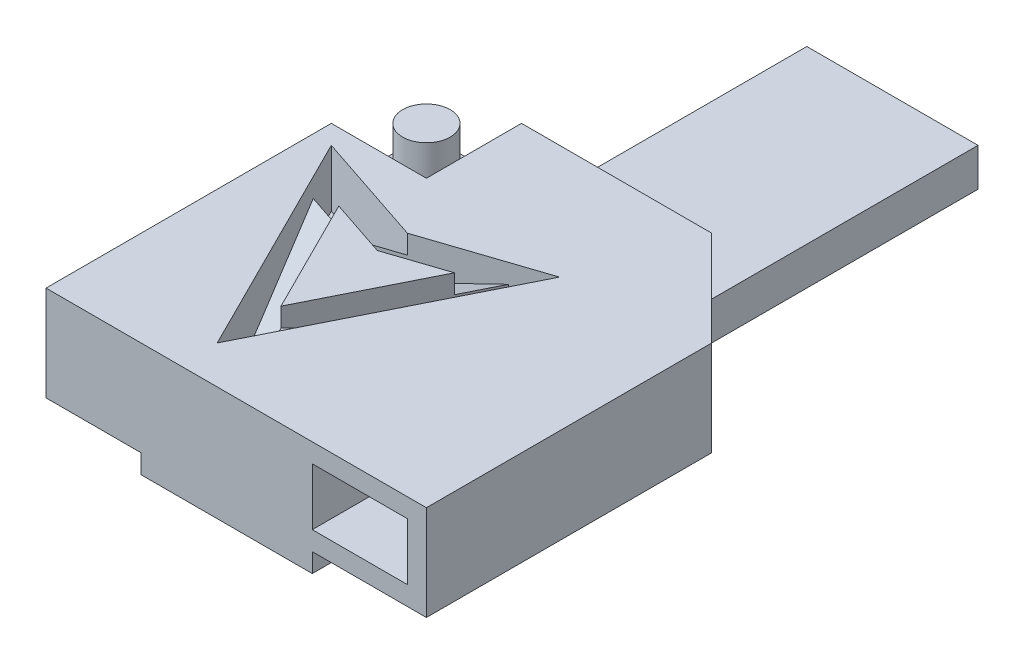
ISO-10303-21;
HEADER;
FILE_DESCRIPTION(('STEP AP214'),'2;1');
FILE_NAME('part.step','',(''),(''),'','','');
FILE_SCHEMA(('AUTOMOTIVE_DESIGN { 1 0 10303 214 1 1 1 1 }'));
ENDSEC;
DATA;
#1=APPLICATION_CONTEXT('core data for automotive mechanical design processes');
#2=APPLICATION_PROTOCOL_DEFINITION('international standard','automotive_design',2000,#1);
#3=PRODUCT_CONTEXT('',#1,'mechanical');
#4=PRODUCT('Part','Part','',(#3));
#5=PRODUCT_RELATED_PRODUCT_CATEGORY('part','',(#4));
#6=PRODUCT_DEFINITION_FORMATION('','',#4);
#7=PRODUCT_DEFINITION_CONTEXT('part definition',#1,'design');
#8=PRODUCT_DEFINITION('design','',#6,#7);
#9=PRODUCT_DEFINITION_SHAPE('','',#8);
#10=(LENGTH_UNIT() NAMED_UNIT(*) SI_UNIT(.MILLI.,.METRE.));
#11=(NAMED_UNIT(*) PLANE_ANGLE_UNIT() SI_UNIT($,.RADIAN.));
#12=(NAMED_UNIT(*) SI_UNIT($,.STERADIAN.) SOLID_ANGLE_UNIT());
#13=UNCERTAINTY_MEASURE_WITH_UNIT(LENGTH_MEASURE(1.E-05),#10,'distance_accuracy_value','');
#14=(GEOMETRIC_REPRESENTATION_CONTEXT(3) GLOBAL_UNCERTAINTY_ASSIGNED_CONTEXT((#13)) GLOBAL_UNIT_ASSIGNED_CONTEXT((#10,
#11,#12)) REPRESENTATION_CONTEXT('',''));
#15=CARTESIAN_POINT('',(0.,0.,0.));
#16=DIRECTION('',(0.,0.,1.));
#17=DIRECTION('',(1.,0.,0.));
#18=AXIS2_PLACEMENT_3D('',#15,#16,#17);
#19=CARTESIAN_POINT('',(-10.,5.,-10.));
#20=DIRECTION('',(0.,0.,1.));
#21=DIRECTION('',(1.,0.,0.));
#22=AXIS2_PLACEMENT_3D('',#19,#20,#21);
#23=PLANE('',#22);
#24=DIRECTION('',(-1.,0.,0.));
#25=VECTOR('',#24,1.);
#26=CARTESIAN_POINT('',(-10.,0.,-10.));
#27=LINE('',#26,#25);
#28=CARTESIAN_POINT('',(5.,0.,-10.));
#29=VERTEX_POINT('',#28);
#30=CARTESIAN_POINT('',(4.,0.,-10.));
#31=VERTEX_POINT('',#30);
#32=EDGE_CURVE('E547',#29,#31,#27,.T.);
#33=ORIENTED_EDGE('',*,*,#32,.T.);
#34=DIRECTION('',(0.,1.,0.));
#35=VECTOR('',#34,1.);
#36=CARTESIAN_POINT('',(4.,5.,-10.));
#37=LINE('',#36,#35);
#38=CARTESIAN_POINT('',(4.,1.,-10.));
#39=VERTEX_POINT('',#38);
#40=EDGE_CURVE('E307',#31,#39,#37,.T.);
#41=ORIENTED_EDGE('',*,*,#40,.T.);
#42=DIRECTION('',(1.,0.,0.));
#43=VECTOR('',#42,1.);
#44=CARTESIAN_POINT('',(9.,1.,-10.));
#45=LINE('',#44,#43);
#46=CARTESIAN_POINT('',(5.,1.,-10.));
#47=VERTEX_POINT('',#46);
#48=EDGE_CURVE('E319',#39,#47,#45,.T.);
#49=ORIENTED_EDGE('',*,*,#48,.T.);
#50=DIRECTION('',(0.,-1.,0.));
#51=VECTOR('',#50,1.);
#52=CARTESIAN_POINT('',(5.,5.,-10.));
#53=LINE('',#52,#51);
#54=EDGE_CURVE('E583',#47,#29,#53,.T.);
#55=ORIENTED_EDGE('',*,*,#54,.T.);
#56=EDGE_LOOP('',(#33,#41,#49,#55));
#57=FACE_BOUND('',#56,.T.);
#58=ADVANCED_FACE('F43',(#57),#23,.F.);
#59=CARTESIAN_POINT('',(0.,0.,0.));
#60=DIRECTION('',(0.,-1.,0.));
#61=DIRECTION('',(0.,0.,-1.));
#62=AXIS2_PLACEMENT_3D('',#59,#60,#61);
#63=PLANE('',#62);
#64=DIRECTION('',(0.,0.,1.));
#65=VECTOR('',#64,1.);
#66=CARTESIAN_POINT('',(4.,0.,0.));
#67=LINE('',#66,#65);
#68=CARTESIAN_POINT('',(4.,0.,10.));
#69=VERTEX_POINT('',#68);
#70=EDGE_CURVE('E304',#31,#69,#67,.T.);
#71=ORIENTED_EDGE('',*,*,#70,.F.);
#72=ORIENTED_EDGE('',*,*,#32,.F.);
#73=DIRECTION('',(-0.707106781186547,0.,-0.707106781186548));
#74=VECTOR('',#73,1.);
#75=CARTESIAN_POINT('',(5.,0.,-10.));
#76=LINE('',#75,#74);
#77=CARTESIAN_POINT('',(10.,0.,-5.));
#78=VERTEX_POINT('',#77);
#79=EDGE_CURVE('E572',#78,#29,#76,.T.);
#80=ORIENTED_EDGE('',*,*,#79,.F.);
#81=DIRECTION('',(0.,0.,-1.));
#82=VECTOR('',#81,1.);
#83=CARTESIAN_POINT('',(10.,0.,10.));
#84=LINE('',#83,#82);
#85=CARTESIAN_POINT('',(10.,0.,10.));
#86=VERTEX_POINT('',#85);
#87=EDGE_CURVE('E569',#86,#78,#84,.T.);
#88=ORIENTED_EDGE('',*,*,#87,.F.);
#89=DIRECTION('',(1.,0.,0.));
#90=VECTOR('',#89,1.);
#91=CARTESIAN_POINT('',(-10.,0.,10.));
#92=LINE('',#91,#90);
#93=EDGE_CURVE('E564',#69,#86,#92,.T.);
#94=ORIENTED_EDGE('',*,*,#93,.F.);
#95=EDGE_LOOP('',(#71,#72,#80,#88,#94));
#96=FACE_BOUND('',#95,.T.);
#97=ADVANCED_FACE('F641',(#96),#63,.T.);
#98=CARTESIAN_POINT('',(0.,2.,0.));
#99=DIRECTION('',(0.,1.,0.));
#100=DIRECTION('',(0.,0.,1.));
#101=AXIS2_PLACEMENT_3D('',#98,#99,#100);
#102=PLANE('',#101);
#103=DIRECTION('',(-0.948683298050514,0.,0.316227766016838));
#104=VECTOR('',#103,1.);
#105=CARTESIAN_POINT('',(-3.,2.,-2.));
#106=LINE('',#105,#104);
#107=CARTESIAN_POINT('',(3.,2.,-4.));
#108=VERTEX_POINT('',#107);
#109=CARTESIAN_POINT('',(0.987538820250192,2.,-3.32917960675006));
#110=VERTEX_POINT('',#109);
#111=EDGE_CURVE('E489',#108,#110,#106,.T.);
#112=ORIENTED_EDGE('',*,*,#111,.T.);
#113=DIRECTION('',(-0.447213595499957,0.,-0.894427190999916));
#114=VECTOR('',#113,1.);
#115=CARTESIAN_POINT('',(8.12259732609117,2.,10.9409374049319));
#116=LINE('',#115,#114);
#117=CARTESIAN_POINT('',(1.82606431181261,2.,-1.65212862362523));
#118=VERTEX_POINT('',#117);
#119=EDGE_CURVE('E364',#118,#110,#116,.T.);
#120=ORIENTED_EDGE('',*,*,#119,.F.);
#121=DIRECTION('',(0.447213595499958,0.,-0.894427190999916));
#122=VECTOR('',#121,1.);
#123=CARTESIAN_POINT('',(3.,2.,-4.));
#124=LINE('',#123,#122);
#125=EDGE_CURVE('E475',#118,#108,#124,.T.);
#126=ORIENTED_EDGE('',*,*,#125,.T.);
#127=EDGE_LOOP('',(#112,#120,#126));
#128=FACE_BOUND('',#127,.T.);
#129=ADVANCED_FACE('F653',(#128),#102,.T.);
#130=CARTESIAN_POINT('',(3.,2.,-4.));
#131=DIRECTION('',(0.894427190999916,0.,0.447213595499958));
#132=DIRECTION('',(0.447213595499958,0.,-0.894427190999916));
#133=AXIS2_PLACEMENT_3D('',#130,#131,#132);
#134=PLANE('',#133);
#135=DIRECTION('',(0.,-1.,0.));
#136=VECTOR('',#135,1.);
#137=CARTESIAN_POINT('',(-2.16147450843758,4.,6.32294901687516));
#138=LINE('',#137,#136);
#139=CARTESIAN_POINT('',(-2.16147450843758,4.,6.32294901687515));
#140=VERTEX_POINT('',#139);
#141=CARTESIAN_POINT('',(-2.16147450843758,2.,6.32294901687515));
#142=VERTEX_POINT('',#141);
#143=EDGE_CURVE('E357',#140,#142,#138,.T.);
#144=ORIENTED_EDGE('',*,*,#143,.T.);
#145=CARTESIAN_POINT('',(-3.,2.,8.));
#146=VERTEX_POINT('',#145);
#147=EDGE_CURVE('E502',#146,#142,#124,.T.);
#148=ORIENTED_EDGE('',*,*,#147,.F.);
#149=DIRECTION('',(0.,1.,0.));
#150=VECTOR('',#149,1.);
#151=CARTESIAN_POINT('',(-3.,2.,8.));
#152=LINE('',#151,#150);
#153=CARTESIAN_POINT('',(-3.,5.,8.));
#154=VERTEX_POINT('',#153);
#155=EDGE_CURVE('E479',#146,#154,#152,.T.);
#156=ORIENTED_EDGE('',*,*,#155,.T.);
#157=DIRECTION('',(0.447213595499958,0.,-0.894427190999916));
#158=VECTOR('',#157,1.);
#159=CARTESIAN_POINT('',(3.,5.,-4.));
#160=LINE('',#159,#158);
#161=CARTESIAN_POINT('',(3.,5.,-4.));
#162=VERTEX_POINT('',#161);
#163=EDGE_CURVE('E484',#154,#162,#160,.T.);
#164=ORIENTED_EDGE('',*,*,#163,.T.);
#165=DIRECTION('',(0.,1.,0.));
#166=VECTOR('',#165,1.);
#167=CARTESIAN_POINT('',(3.,2.,-4.));
#168=LINE('',#167,#166);
#169=EDGE_CURVE('E426',#108,#162,#168,.T.);
#170=ORIENTED_EDGE('',*,*,#169,.F.);
#171=ORIENTED_EDGE('',*,*,#125,.F.);
#172=DIRECTION('',(-0.436370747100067,0.218867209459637,0.872741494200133));
#173=VECTOR('',#172,1.);
#174=CARTESIAN_POINT('',(-1.77088235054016,3.80409361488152,5.54176470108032));
#175=LINE('',#174,#173);
#176=EDGE_CURVE('E367',#118,#140,#175,.T.);
#177=ORIENTED_EDGE('',*,*,#176,.T.);
#178=EDGE_LOOP('',(#144,#148,#156,#164,#170,#171,#177));
#179=FACE_BOUND('',#178,.T.);
#180=ADVANCED_FACE('F656',(#179),#134,.F.);
#181=CARTESIAN_POINT('',(0.0388555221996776,2.,-1.43181301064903));
#182=DIRECTION('',(0.894427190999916,0.,0.447213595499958));
#183=DIRECTION('',(0.447213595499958,0.,-0.894427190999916));
#184=AXIS2_PLACEMENT_3D('',#181,#182,#183);
#185=PLANE('',#184);
#186=DIRECTION('',(0.,1.,0.));
#187=VECTOR('',#186,1.);
#188=CARTESIAN_POINT('',(-3.,2.,4.64589803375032));
#189=LINE('',#188,#187);
#190=CARTESIAN_POINT('',(-3.,4.,4.64589803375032));
#191=VERTEX_POINT('',#190);
#192=CARTESIAN_POINT('',(-3.,5.,4.64589803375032));
#193=VERTEX_POINT('',#192);
#194=EDGE_CURVE('E524',#191,#193,#189,.T.);
#195=ORIENTED_EDGE('',*,*,#194,.F.);
#196=DIRECTION('',(-0.436370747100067,0.218867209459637,0.872741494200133));
#197=VECTOR('',#196,1.);
#198=CARTESIAN_POINT('',(0.987538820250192,2.,-3.32917960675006));
#199=LINE('',#198,#197);
#200=EDGE_CURVE('E358',#110,#191,#199,.T.);
#201=ORIENTED_EDGE('',*,*,#200,.F.);
#202=DIRECTION('',(0.,1.,0.));
#203=VECTOR('',#202,1.);
#204=CARTESIAN_POINT('',(0.987538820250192,4.,-3.32917960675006));
#205=LINE('',#204,#203);
#206=CARTESIAN_POINT('',(0.987538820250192,4.,-3.32917960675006));
#207=VERTEX_POINT('',#206);
#208=EDGE_CURVE('E387',#110,#207,#205,.T.);
#209=ORIENTED_EDGE('',*,*,#208,.T.);
#210=DIRECTION('',(0.447213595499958,0.,-0.894427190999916));
#211=VECTOR('',#210,1.);
#212=CARTESIAN_POINT('',(-6.54253521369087,4.,11.7309684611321));
#213=LINE('',#212,#211);
#214=CARTESIAN_POINT('',(0.0388555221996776,4.,-1.43181301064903));
#215=VERTEX_POINT('',#214);
#216=EDGE_CURVE('E379',#215,#207,#213,.T.);
#217=ORIENTED_EDGE('',*,*,#216,.F.);
#218=DIRECTION('',(0.,1.,0.));
#219=VECTOR('',#218,1.);
#220=CARTESIAN_POINT('',(0.0388555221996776,2.,-1.43181301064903));
#221=LINE('',#220,#219);
#222=CARTESIAN_POINT('',(0.0388555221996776,5.,-1.43181301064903));
#223=VERTEX_POINT('',#222);
#224=EDGE_CURVE('E501',#215,#223,#221,.T.);
#225=ORIENTED_EDGE('',*,*,#224,.T.);
#226=DIRECTION('',(0.447213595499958,0.,-0.894427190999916));
#227=VECTOR('',#226,1.);
#228=CARTESIAN_POINT('',(0.0388555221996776,5.,-1.43181301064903));
#229=LINE('',#228,#227);
#230=EDGE_CURVE('E520',#193,#223,#229,.T.);
#231=ORIENTED_EDGE('',*,*,#230,.F.);
#232=EDGE_LOOP('',(#195,#201,#209,#217,#225,#231));
#233=FACE_BOUND('',#232,.T.);
#234=ADVANCED_FACE('F666',(#233),#185,.T.);
#235=CARTESIAN_POINT('',(-6.03885552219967,2.,-1.43181301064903));
#236=DIRECTION('',(0.316227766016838,0.,-0.948683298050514));
#237=DIRECTION('',(-0.948683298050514,0.,-0.316227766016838));
#238=AXIS2_PLACEMENT_3D('',#235,#236,#237);
#239=PLANE('',#238);
#240=DIRECTION('',(0.,1.,0.));
#241=VECTOR('',#240,1.);
#242=CARTESIAN_POINT('',(-3.,2.,-0.418861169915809));
#243=LINE('',#242,#241);
#244=CARTESIAN_POINT('',(-3.,3.04427191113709,-0.418861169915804));
#245=VERTEX_POINT('',#244);
#246=CARTESIAN_POINT('',(-3.,5.,-0.418861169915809));
#247=VERTEX_POINT('',#246);
#248=EDGE_CURVE('E517',#245,#247,#243,.T.);
#249=ORIENTED_EDGE('',*,*,#248,.F.);
#250=DIRECTION('',(0.875383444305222,0.385434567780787,0.291794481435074));
#251=VECTOR('',#250,1.);
#252=CARTESIAN_POINT('',(-7.29513055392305,1.15311004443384,-1.85057135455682));
#253=LINE('',#252,#251);
#254=CARTESIAN_POINT('',(-5.37170824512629,2.,-1.2094305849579));
#255=VERTEX_POINT('',#254);
#256=EDGE_CURVE('E376',#255,#245,#253,.T.);
#257=ORIENTED_EDGE('',*,*,#256,.F.);
#258=DIRECTION('',(0.,-1.,0.));
#259=VECTOR('',#258,1.);
#260=CARTESIAN_POINT('',(-5.37170824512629,4.,-1.2094305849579));
#261=LINE('',#260,#259);
#262=CARTESIAN_POINT('',(-5.37170824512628,4.,-1.2094305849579));
#263=VERTEX_POINT('',#262);
#264=EDGE_CURVE('E397',#263,#255,#261,.T.);
#265=ORIENTED_EDGE('',*,*,#264,.F.);
#266=DIRECTION('',(0.774242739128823,0.577877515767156,0.258080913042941));
#267=VECTOR('',#266,1.);
#268=CARTESIAN_POINT('',(-8.05131670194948,2.,-2.10263340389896));
#269=LINE('',#268,#267);
#270=CARTESIAN_POINT('',(-8.05131670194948,2.,-2.10263340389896));
#271=VERTEX_POINT('',#270);
#272=EDGE_CURVE('E393',#271,#263,#269,.T.);
#273=ORIENTED_EDGE('',*,*,#272,.F.);
#274=DIRECTION('',(0.,-1.,0.));
#275=VECTOR('',#274,1.);
#276=CARTESIAN_POINT('',(-8.05131670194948,2.,-2.10263340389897));
#277=LINE('',#276,#275);
#278=CARTESIAN_POINT('',(-8.05131670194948,4.,-2.10263340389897));
#279=VERTEX_POINT('',#278);
#280=EDGE_CURVE('E422',#279,#271,#277,.T.);
#281=ORIENTED_EDGE('',*,*,#280,.F.);
#282=DIRECTION('',(0.948683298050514,0.,0.316227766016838));
#283=VECTOR('',#282,1.);
#284=CARTESIAN_POINT('',(-17.9923105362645,4.,-5.41629801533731));
#285=LINE('',#284,#283);
#286=CARTESIAN_POINT('',(-6.03885552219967,4.,-1.43181301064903));
#287=VERTEX_POINT('',#286);
#288=EDGE_CURVE('E414',#279,#287,#285,.T.);
#289=ORIENTED_EDGE('',*,*,#288,.T.);
#290=DIRECTION('',(0.,1.,0.));
#291=VECTOR('',#290,1.);
#292=CARTESIAN_POINT('',(-6.03885552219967,2.,-1.43181301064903));
#293=LINE('',#292,#291);
#294=CARTESIAN_POINT('',(-6.03885552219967,5.,-1.43181301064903));
#295=VERTEX_POINT('',#294);
#296=EDGE_CURVE('E521',#287,#295,#293,.T.);
#297=ORIENTED_EDGE('',*,*,#296,.T.);
#298=DIRECTION('',(-0.948683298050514,0.,-0.316227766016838));
#299=VECTOR('',#298,1.);
#300=CARTESIAN_POINT('',(-6.03885552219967,5.,-1.43181301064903));
#301=LINE('',#300,#299);
#302=EDGE_CURVE('E536',#247,#295,#301,.T.);
#303=ORIENTED_EDGE('',*,*,#302,.F.);
#304=EDGE_LOOP('',(#249,#257,#265,#273,#281,#289,#297,#303));
#305=FACE_BOUND('',#304,.T.);
#306=ADVANCED_FACE('F701',(#305),#239,.T.);
#307=CARTESIAN_POINT('',(-3.,2.,-2.));
#308=DIRECTION('',(-0.316227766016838,0.,-0.948683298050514));
#309=DIRECTION('',(-0.948683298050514,0.,0.316227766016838));
#310=AXIS2_PLACEMENT_3D('',#307,#308,#309);
#311=PLANE('',#310);
#312=DIRECTION('',(-0.909082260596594,-0.285908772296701,0.303027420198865));
#313=VECTOR('',#312,1.);
#314=CARTESIAN_POINT('',(-5.37170824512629,2.,-1.2094305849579));
#315=LINE('',#314,#313);
#316=EDGE_CURVE('E383',#207,#255,#315,.T.);
#317=ORIENTED_EDGE('',*,*,#316,.F.);
#318=ORIENTED_EDGE('',*,*,#208,.F.);
#319=ORIENTED_EDGE('',*,*,#111,.F.);
#320=ORIENTED_EDGE('',*,*,#169,.T.);
#321=DIRECTION('',(-0.948683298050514,0.,0.316227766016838));
#322=VECTOR('',#321,1.);
#323=CARTESIAN_POINT('',(-3.,5.,-2.));
#324=LINE('',#323,#322);
#325=CARTESIAN_POINT('',(-3.,5.,-2.));
#326=VERTEX_POINT('',#325);
#327=EDGE_CURVE('E497',#162,#326,#324,.T.);
#328=ORIENTED_EDGE('',*,*,#327,.T.);
#329=DIRECTION('',(0.,1.,0.));
#330=VECTOR('',#329,1.);
#331=CARTESIAN_POINT('',(-3.,2.,-2.));
#332=LINE('',#331,#330);
#333=CARTESIAN_POINT('',(-2.99999999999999,4.,-2.));
#334=VERTEX_POINT('',#333);
#335=EDGE_CURVE('E472',#334,#326,#332,.T.);
#336=ORIENTED_EDGE('',*,*,#335,.F.);
#337=DIRECTION('',(-0.948683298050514,0.,0.316227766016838));
#338=VECTOR('',#337,1.);
#339=CARTESIAN_POINT('',(11.7455841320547,4.,-6.91519471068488));
#340=LINE('',#339,#338);
#341=EDGE_CURVE('E402',#334,#263,#340,.T.);
#342=ORIENTED_EDGE('',*,*,#341,.T.);
#343=ORIENTED_EDGE('',*,*,#264,.T.);
#344=EDGE_LOOP('',(#317,#318,#319,#320,#328,#336,#342,#343));
#345=FACE_BOUND('',#344,.T.);
#346=ADVANCED_FACE('F662',(#345),#311,.F.);
#347=CARTESIAN_POINT('',(-3.,2.,-0.418861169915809));
#348=DIRECTION('',(-0.316227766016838,0.,-0.948683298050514));
#349=DIRECTION('',(-0.948683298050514,0.,0.316227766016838));
#350=AXIS2_PLACEMENT_3D('',#347,#348,#349);
#351=PLANE('',#350);
#352=ORIENTED_EDGE('',*,*,#224,.F.);
#353=DIRECTION('',(0.909082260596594,0.285908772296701,-0.303027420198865));
#354=VECTOR('',#353,1.);
#355=CARTESIAN_POINT('',(-15.3854955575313,-0.850999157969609,3.7096373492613));
#356=LINE('',#355,#354);
#357=EDGE_CURVE('E362',#245,#215,#356,.T.);
#358=ORIENTED_EDGE('',*,*,#357,.F.);
#359=ORIENTED_EDGE('',*,*,#248,.T.);
#360=DIRECTION('',(-0.948683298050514,0.,0.316227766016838));
#361=VECTOR('',#360,1.);
#362=CARTESIAN_POINT('',(-3.,5.,-0.418861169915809));
#363=LINE('',#362,#361);
#364=EDGE_CURVE('E439',#223,#247,#363,.T.);
#365=ORIENTED_EDGE('',*,*,#364,.F.);
#366=EDGE_LOOP('',(#352,#358,#359,#365));
#367=FACE_BOUND('',#366,.T.);
#368=ADVANCED_FACE('F710',(#367),#351,.T.);
#369=DIRECTION('',(0.447213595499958,0.,0.894427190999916));
#370=VECTOR('',#369,1.);
#371=CARTESIAN_POINT('',(-3.,2.,8.));
#372=LINE('',#371,#370);
#373=CARTESIAN_POINT('',(-9.,2.,-4.));
#374=VERTEX_POINT('',#373);
#375=EDGE_CURVE('E507',#374,#271,#372,.T.);
#376=ORIENTED_EDGE('',*,*,#375,.T.);
#377=DIRECTION('',(-0.948683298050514,0.,0.316227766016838));
#378=VECTOR('',#377,1.);
#379=CARTESIAN_POINT('',(9.06597567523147,2.,-7.80839752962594));
#380=LINE('',#379,#378);
#381=CARTESIAN_POINT('',(-5.67960845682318,2.,-2.89320281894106));
#382=VERTEX_POINT('',#381);
#383=EDGE_CURVE('E401',#382,#271,#380,.T.);
#384=ORIENTED_EDGE('',*,*,#383,.F.);
#385=DIRECTION('',(-0.948683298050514,0.,-0.316227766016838));
#386=VECTOR('',#385,1.);
#387=CARTESIAN_POINT('',(-9.,2.,-4.));
#388=LINE('',#387,#386);
#389=EDGE_CURVE('E511',#382,#374,#388,.T.);
#390=ORIENTED_EDGE('',*,*,#389,.T.);
#391=EDGE_LOOP('',(#376,#384,#390));
#392=FACE_BOUND('',#391,.T.);
#393=ADVANCED_FACE('F698',(#392),#102,.T.);
#394=CARTESIAN_POINT('',(-9.,2.,-4.));
#395=DIRECTION('',(0.316227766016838,0.,-0.948683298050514));
#396=DIRECTION('',(-0.948683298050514,0.,-0.316227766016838));
#397=AXIS2_PLACEMENT_3D('',#394,#395,#396);
#398=PLANE('',#397);
#399=DIRECTION('',(0.774242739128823,0.577877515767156,0.258080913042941));
#400=VECTOR('',#399,1.);
#401=CARTESIAN_POINT('',(2.17751797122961,7.86438396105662,-0.274160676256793));
#402=LINE('',#401,#400);
#403=EDGE_CURVE('E386',#382,#334,#402,.T.);
#404=ORIENTED_EDGE('',*,*,#403,.T.);
#405=ORIENTED_EDGE('',*,*,#335,.T.);
#406=DIRECTION('',(-0.948683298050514,0.,-0.316227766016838));
#407=VECTOR('',#406,1.);
#408=CARTESIAN_POINT('',(-9.,5.,-4.));
#409=LINE('',#408,#407);
#410=CARTESIAN_POINT('',(-9.,5.,-4.));
#411=VERTEX_POINT('',#410);
#412=EDGE_CURVE('E493',#326,#411,#409,.T.);
#413=ORIENTED_EDGE('',*,*,#412,.T.);
#414=DIRECTION('',(0.,1.,0.));
#415=VECTOR('',#414,1.);
#416=CARTESIAN_POINT('',(-9.,2.,-4.));
#417=LINE('',#416,#415);
#418=EDGE_CURVE('E476',#374,#411,#417,.T.);
#419=ORIENTED_EDGE('',*,*,#418,.F.);
#420=ORIENTED_EDGE('',*,*,#389,.F.);
#421=EDGE_LOOP('',(#404,#405,#413,#419,#420));
#422=FACE_BOUND('',#421,.T.);
#423=ADVANCED_FACE('F691',(#422),#398,.F.);
#424=CARTESIAN_POINT('',(-3.,2.,8.));
#425=DIRECTION('',(-0.894427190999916,0.,0.447213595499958));
#426=DIRECTION('',(0.447213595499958,0.,0.894427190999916));
#427=AXIS2_PLACEMENT_3D('',#424,#425,#426);
#428=PLANE('',#427);
#429=DIRECTION('',(-0.435769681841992,0.22477526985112,-0.871539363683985));
#430=VECTOR('',#429,1.);
#431=CARTESIAN_POINT('',(-11.1975619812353,5.62287134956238,-8.39512396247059));
#432=LINE('',#431,#430);
#433=CARTESIAN_POINT('',(-4.17393568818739,2.,5.65212862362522));
#434=VERTEX_POINT('',#433);
#435=EDGE_CURVE('E418',#434,#279,#432,.T.);
#436=ORIENTED_EDGE('',*,*,#435,.T.);
#437=ORIENTED_EDGE('',*,*,#280,.T.);
#438=ORIENTED_EDGE('',*,*,#375,.F.);
#439=ORIENTED_EDGE('',*,*,#418,.T.);
#440=DIRECTION('',(0.447213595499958,0.,0.894427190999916));
#441=VECTOR('',#440,1.);
#442=CARTESIAN_POINT('',(-3.,5.,8.));
#443=LINE('',#442,#441);
#444=EDGE_CURVE('E488',#411,#154,#443,.T.);
#445=ORIENTED_EDGE('',*,*,#444,.T.);
#446=ORIENTED_EDGE('',*,*,#155,.F.);
#447=EDGE_CURVE('E506',#434,#146,#372,.T.);
#448=ORIENTED_EDGE('',*,*,#447,.F.);
#449=EDGE_LOOP('',(#436,#437,#438,#439,#445,#446,#448));
#450=FACE_BOUND('',#449,.T.);
#451=ADVANCED_FACE('F682',(#450),#428,.F.);
#452=ORIENTED_EDGE('',*,*,#147,.T.);
#453=DIRECTION('',(0.948683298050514,0.,0.316227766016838));
#454=VECTOR('',#453,1.);
#455=CARTESIAN_POINT('',(-14.1149295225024,2.,2.33846401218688));
#456=LINE('',#455,#454);
#457=EDGE_CURVE('E413',#434,#142,#456,.T.);
#458=ORIENTED_EDGE('',*,*,#457,.F.);
#459=ORIENTED_EDGE('',*,*,#447,.T.);
#460=EDGE_LOOP('',(#452,#458,#459));
#461=FACE_BOUND('',#460,.T.);
#462=ADVANCED_FACE('F679',(#461),#102,.T.);
#463=CARTESIAN_POINT('',(-3.,2.,4.64589803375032));
#464=DIRECTION('',(-0.894427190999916,0.,0.447213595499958));
#465=DIRECTION('',(0.447213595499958,0.,0.894427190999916));
#466=AXIS2_PLACEMENT_3D('',#463,#464,#465);
#467=PLANE('',#466);
#468=ORIENTED_EDGE('',*,*,#296,.F.);
#469=DIRECTION('',(-0.435769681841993,0.22477526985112,-0.871539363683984));
#470=VECTOR('',#469,1.);
#471=CARTESIAN_POINT('',(-6.03885552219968,4.,-1.43181301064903));
#472=LINE('',#471,#470);
#473=EDGE_CURVE('E396',#142,#287,#472,.T.);
#474=ORIENTED_EDGE('',*,*,#473,.F.);
#475=ORIENTED_EDGE('',*,*,#143,.F.);
#476=DIRECTION('',(-0.447213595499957,0.,-0.894427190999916));
#477=VECTOR('',#476,1.);
#478=CARTESIAN_POINT('',(4.13505850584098,4.,18.9160150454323));
#479=LINE('',#478,#477);
#480=EDGE_CURVE('E363',#140,#191,#479,.T.);
#481=ORIENTED_EDGE('',*,*,#480,.T.);
#482=ORIENTED_EDGE('',*,*,#194,.T.);
#483=DIRECTION('',(0.447213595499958,0.,0.894427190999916));
#484=VECTOR('',#483,1.);
#485=CARTESIAN_POINT('',(-3.,5.,4.64589803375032));
#486=LINE('',#485,#484);
#487=EDGE_CURVE('E532',#295,#193,#486,.T.);
#488=ORIENTED_EDGE('',*,*,#487,.F.);
#489=EDGE_LOOP('',(#468,#474,#475,#481,#482,#488));
#490=FACE_BOUND('',#489,.T.);
#491=ADVANCED_FACE('F715',(#490),#467,.T.);
#492=CARTESIAN_POINT('',(-10.,5.,10.));
#493=DIRECTION('',(1.,0.,0.));
#494=DIRECTION('',(0.,0.,-1.));
#495=AXIS2_PLACEMENT_3D('',#492,#493,#494);
#496=PLANE('',#495);
#497=DIRECTION('',(0.,0.,1.));
#498=VECTOR('',#497,1.);
#499=CARTESIAN_POINT('',(-10.,5.,10.));
#500=LINE('',#499,#498);
#501=CARTESIAN_POINT('',(-10.,5.,-5.));
#502=VERTEX_POINT('',#501);
#503=CARTESIAN_POINT('',(-10.,5.,10.));
#504=VERTEX_POINT('',#503);
#505=EDGE_CURVE('E543',#502,#504,#500,.T.);
#506=ORIENTED_EDGE('',*,*,#505,.F.);
#507=DIRECTION('',(0.,1.,0.));
#508=VECTOR('',#507,1.);
#509=CARTESIAN_POINT('',(-10.,2.,-5.));
#510=LINE('',#509,#508);
#511=CARTESIAN_POINT('',(-10.,2.,-5.));
#512=VERTEX_POINT('',#511);
#513=EDGE_CURVE('E456',#512,#502,#510,.T.);
#514=ORIENTED_EDGE('',*,*,#513,.F.);
#515=DIRECTION('',(0.,0.,1.));
#516=VECTOR('',#515,1.);
#517=CARTESIAN_POINT('',(-10.,2.,-10.));
#518=LINE('',#517,#516);
#519=CARTESIAN_POINT('',(-10.,2.,-10.));
#520=VERTEX_POINT('',#519);
#521=EDGE_CURVE('E440',#520,#512,#518,.T.);
#522=ORIENTED_EDGE('',*,*,#521,.F.);
#523=DIRECTION('',(0.,-1.,0.));
#524=VECTOR('',#523,1.);
#525=CARTESIAN_POINT('',(-10.,5.,-10.));
#526=LINE('',#525,#524);
#527=CARTESIAN_POINT('',(-10.,0.,-10.));
#528=VERTEX_POINT('',#527);
#529=EDGE_CURVE('E560',#520,#528,#526,.T.);
#530=ORIENTED_EDGE('',*,*,#529,.T.);
#531=DIRECTION('',(0.,0.,1.));
#532=VECTOR('',#531,1.);
#533=CARTESIAN_POINT('',(-10.,0.,10.));
#534=LINE('',#533,#532);
#535=CARTESIAN_POINT('',(-10.,0.,10.));
#536=VERTEX_POINT('',#535);
#537=EDGE_CURVE('E466',#528,#536,#534,.T.);
#538=ORIENTED_EDGE('',*,*,#537,.T.);
#539=DIRECTION('',(0.,-1.,0.));
#540=VECTOR('',#539,1.);
#541=CARTESIAN_POINT('',(-10.,5.,10.));
#542=LINE('',#541,#540);
#543=EDGE_CURVE('E596',#504,#536,#542,.T.);
#544=ORIENTED_EDGE('',*,*,#543,.F.);
#545=EDGE_LOOP('',(#506,#514,#522,#530,#538,#544));
#546=FACE_BOUND('',#545,.T.);
#547=ADVANCED_FACE('F45',(#546),#496,.F.);
#548=CARTESIAN_POINT('',(-10.,5.,10.));
#549=DIRECTION('',(0.,0.,-1.));
#550=DIRECTION('',(-1.,0.,0.));
#551=AXIS2_PLACEMENT_3D('',#548,#549,#550);
#552=PLANE('',#551);
#553=DIRECTION('',(0.,-1.,0.));
#554=VECTOR('',#553,1.);
#555=CARTESIAN_POINT('',(4.,1.,10.));
#556=LINE('',#555,#554);
#557=CARTESIAN_POINT('',(4.,-1.,10.));
#558=VERTEX_POINT('',#557);
#559=EDGE_CURVE('E59',#69,#558,#556,.T.);
#560=ORIENTED_EDGE('',*,*,#559,.F.);
#561=ORIENTED_EDGE('',*,*,#93,.T.);
#562=DIRECTION('',(0.,-1.,0.));
#563=VECTOR('',#562,1.);
#564=CARTESIAN_POINT('',(10.,5.,10.));
#565=LINE('',#564,#563);
#566=CARTESIAN_POINT('',(10.,5.,10.));
#567=VERTEX_POINT('',#566);
#568=EDGE_CURVE('E592',#567,#86,#565,.T.);
#569=ORIENTED_EDGE('',*,*,#568,.F.);
#570=DIRECTION('',(1.,0.,0.));
#571=VECTOR('',#570,1.);
#572=CARTESIAN_POINT('',(-10.,5.,10.));
#573=LINE('',#572,#571);
#574=EDGE_CURVE('E546',#504,#567,#573,.T.);
#575=ORIENTED_EDGE('',*,*,#574,.F.);
#576=ORIENTED_EDGE('',*,*,#543,.T.);
#577=CARTESIAN_POINT('',(-5.,0.,10.));
#578=VERTEX_POINT('',#577);
#579=EDGE_CURVE('E565',#536,#578,#92,.T.);
#580=ORIENTED_EDGE('',*,*,#579,.T.);
#581=DIRECTION('',(0.,1.,0.));
#582=VECTOR('',#581,1.);
#583=CARTESIAN_POINT('',(-5.,1.,10.));
#584=LINE('',#583,#582);
#585=CARTESIAN_POINT('',(-5.,-1.,10.));
#586=VERTEX_POINT('',#585);
#587=EDGE_CURVE('E263',#586,#578,#584,.T.);
#588=ORIENTED_EDGE('',*,*,#587,.F.);
#589=DIRECTION('',(-1.,0.,0.));
#590=VECTOR('',#589,1.);
#591=CARTESIAN_POINT('',(4.,-1.,10.));
#592=LINE('',#591,#590);
#593=EDGE_CURVE('E287',#558,#586,#592,.T.);
#594=ORIENTED_EDGE('',*,*,#593,.F.);
#595=EDGE_LOOP('',(#560,#561,#569,#575,#576,#580,#588,#594));
#596=FACE_BOUND('',#595,.T.);
#597=DIRECTION('',(1.,0.,0.));
#598=VECTOR('',#597,1.);
#599=CARTESIAN_POINT('',(9.,1.,10.));
#600=LINE('',#599,#598);
#601=CARTESIAN_POINT('',(4.,1.,10.));
#602=VERTEX_POINT('',#601);
#603=CARTESIAN_POINT('',(9.,1.,10.));
#604=VERTEX_POINT('',#603);
#605=EDGE_CURVE('E320',#602,#604,#600,.T.);
#606=ORIENTED_EDGE('',*,*,#605,.F.);
#607=DIRECTION('',(0.,-1.,0.));
#608=VECTOR('',#607,1.);
#609=CARTESIAN_POINT('',(4.,1.,10.));
#610=LINE('',#609,#608);
#611=CARTESIAN_POINT('',(4.,4.,10.));
#612=VERTEX_POINT('',#611);
#613=EDGE_CURVE('E331',#612,#602,#610,.T.);
#614=ORIENTED_EDGE('',*,*,#613,.F.);
#615=DIRECTION('',(-1.,0.,0.));
#616=VECTOR('',#615,1.);
#617=CARTESIAN_POINT('',(9.,4.,10.));
#618=LINE('',#617,#616);
#619=CARTESIAN_POINT('',(9.,4.,10.));
#620=VERTEX_POINT('',#619);
#621=EDGE_CURVE('E327',#620,#612,#618,.T.);
#622=ORIENTED_EDGE('',*,*,#621,.F.);
#623=DIRECTION('',(0.,1.,0.));
#624=VECTOR('',#623,1.);
#625=CARTESIAN_POINT('',(9.,1.,10.));
#626=LINE('',#625,#624);
#627=EDGE_CURVE('E67',#604,#620,#626,.T.);
#628=ORIENTED_EDGE('',*,*,#627,.F.);
#629=EDGE_LOOP('',(#606,#614,#622,#628));
#630=FACE_BOUND('',#629,.T.);
#631=ADVANCED_FACE('F619',(#596,#630),#552,.F.);
#632=CARTESIAN_POINT('',(10.,5.,10.));
#633=DIRECTION('',(-1.,0.,0.));
#634=DIRECTION('',(0.,0.,1.));
#635=AXIS2_PLACEMENT_3D('',#632,#633,#634);
#636=PLANE('',#635);
#637=ORIENTED_EDGE('',*,*,#87,.T.);
#638=DIRECTION('',(0.,-1.,0.));
#639=VECTOR('',#638,1.);
#640=CARTESIAN_POINT('',(10.,5.,-5.));
#641=LINE('',#640,#639);
#642=CARTESIAN_POINT('',(10.,5.,-5.));
#643=VERTEX_POINT('',#642);
#644=EDGE_CURVE('E588',#643,#78,#641,.T.);
#645=ORIENTED_EDGE('',*,*,#644,.F.);
#646=DIRECTION('',(0.,0.,-1.));
#647=VECTOR('',#646,1.);
#648=CARTESIAN_POINT('',(10.,5.,10.));
#649=LINE('',#648,#647);
#650=EDGE_CURVE('E550',#567,#643,#649,.T.);
#651=ORIENTED_EDGE('',*,*,#650,.F.);
#652=ORIENTED_EDGE('',*,*,#568,.T.);
#653=EDGE_LOOP('',(#637,#645,#651,#652));
#654=FACE_BOUND('',#653,.T.);
#655=ADVANCED_FACE('F636',(#654),#636,.F.);
#656=CARTESIAN_POINT('',(5.,5.,-10.));
#657=DIRECTION('',(-0.707106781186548,0.,0.707106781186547));
#658=DIRECTION('',(0.707106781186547,0.,0.707106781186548));
#659=AXIS2_PLACEMENT_3D('',#656,#657,#658);
#660=PLANE('',#659);
#661=ORIENTED_EDGE('',*,*,#54,.F.);
#662=DIRECTION('',(0.707106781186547,0.,0.707106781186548));
#663=VECTOR('',#662,1.);
#664=CARTESIAN_POINT('',(5.,0.999999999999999,-10.));
#665=LINE('',#664,#663);
#666=CARTESIAN_POINT('',(9.,1.,-5.99999999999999));
#667=VERTEX_POINT('',#666);
#668=EDGE_CURVE('E353',#47,#667,#665,.T.);
#669=ORIENTED_EDGE('',*,*,#668,.T.);
#670=DIRECTION('',(0.,1.,0.));
#671=VECTOR('',#670,1.);
#672=CARTESIAN_POINT('',(9.,5.,-6.));
#673=LINE('',#672,#671);
#674=CARTESIAN_POINT('',(9.,4.,-5.99999999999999));
#675=VERTEX_POINT('',#674);
#676=EDGE_CURVE('E52',#667,#675,#673,.T.);
#677=ORIENTED_EDGE('',*,*,#676,.T.);
#678=DIRECTION('',(-0.707106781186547,0.,-0.707106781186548));
#679=VECTOR('',#678,1.);
#680=CARTESIAN_POINT('',(5.,4.,-10.));
#681=LINE('',#680,#679);
#682=CARTESIAN_POINT('',(5.,4.,-10.));
#683=VERTEX_POINT('',#682);
#684=EDGE_CURVE('E341',#675,#683,#681,.T.);
#685=ORIENTED_EDGE('',*,*,#684,.T.);
#686=CARTESIAN_POINT('',(5.,5.,-10.));
#687=VERTEX_POINT('',#686);
#688=EDGE_CURVE('E584',#687,#683,#53,.T.);
#689=ORIENTED_EDGE('',*,*,#688,.F.);
#690=DIRECTION('',(-0.707106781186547,0.,-0.707106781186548));
#691=VECTOR('',#690,1.);
#692=CARTESIAN_POINT('',(5.,5.,-10.));
#693=LINE('',#692,#691);
#694=EDGE_CURVE('E553',#643,#687,#693,.T.);
#695=ORIENTED_EDGE('',*,*,#694,.F.);
#696=ORIENTED_EDGE('',*,*,#644,.T.);
#697=ORIENTED_EDGE('',*,*,#79,.T.);
#698=EDGE_LOOP('',(#661,#669,#677,#685,#689,#695,#696,#697));
#699=FACE_BOUND('',#698,.T.);
#700=ADVANCED_FACE('F607',(#699),#660,.F.);
#701=DIRECTION('',(0.,-1.,0.));
#702=VECTOR('',#701,1.);
#703=CARTESIAN_POINT('',(4.,1.,-10.));
#704=LINE('',#703,#702);
#705=CARTESIAN_POINT('',(4.,4.,-10.));
#706=VERTEX_POINT('',#705);
#707=EDGE_CURVE('E315',#706,#39,#704,.T.);
#708=ORIENTED_EDGE('',*,*,#707,.T.);
#709=DIRECTION('',(-1.,0.,0.));
#710=VECTOR('',#709,1.);
#711=CARTESIAN_POINT('',(-10.,1.,-10.));
#712=LINE('',#711,#710);
#713=CARTESIAN_POINT('',(-5.,1.,-10.));
#714=VERTEX_POINT('',#713);
#715=EDGE_CURVE('E295',#39,#714,#712,.T.);
#716=ORIENTED_EDGE('',*,*,#715,.T.);
#717=DIRECTION('',(0.,-1.,0.));
#718=VECTOR('',#717,1.);
#719=CARTESIAN_POINT('',(-5.,5.,-10.));
#720=LINE('',#719,#718);
#721=CARTESIAN_POINT('',(-5.,0.,-10.));
#722=VERTEX_POINT('',#721);
#723=EDGE_CURVE('E311',#714,#722,#720,.T.);
#724=ORIENTED_EDGE('',*,*,#723,.T.);
#725=EDGE_CURVE('E576',#722,#528,#27,.T.);
#726=ORIENTED_EDGE('',*,*,#725,.T.);
#727=ORIENTED_EDGE('',*,*,#529,.F.);
#728=DIRECTION('',(-1.,0.,0.));
#729=VECTOR('',#728,1.);
#730=CARTESIAN_POINT('',(-10.,2.,-10.));
#731=LINE('',#730,#729);
#732=CARTESIAN_POINT('',(-5.,2.,-10.));
#733=VERTEX_POINT('',#732);
#734=EDGE_CURVE('E453',#733,#520,#731,.T.);
#735=ORIENTED_EDGE('',*,*,#734,.F.);
#736=DIRECTION('',(0.,1.,0.));
#737=VECTOR('',#736,1.);
#738=CARTESIAN_POINT('',(-5.,2.,-10.));
#739=LINE('',#738,#737);
#740=CARTESIAN_POINT('',(-5.,5.,-10.));
#741=VERTEX_POINT('',#740);
#742=EDGE_CURVE('E462',#733,#741,#739,.T.);
#743=ORIENTED_EDGE('',*,*,#742,.T.);
#744=DIRECTION('',(-1.,0.,0.));
#745=VECTOR('',#744,1.);
#746=CARTESIAN_POINT('',(-10.,5.,-10.));
#747=LINE('',#746,#745);
#748=EDGE_CURVE('E556',#687,#741,#747,.T.);
#749=ORIENTED_EDGE('',*,*,#748,.F.);
#750=ORIENTED_EDGE('',*,*,#688,.T.);
#751=DIRECTION('',(-1.,0.,0.));
#752=VECTOR('',#751,1.);
#753=CARTESIAN_POINT('',(-10.,4.,-10.));
#754=LINE('',#753,#752);
#755=EDGE_CURVE('E600',#683,#706,#754,.T.);
#756=ORIENTED_EDGE('',*,*,#755,.T.);
#757=EDGE_LOOP('',(#708,#716,#724,#726,#727,#735,#743,#749,#750,#756));
#758=FACE_BOUND('',#757,.T.);
#759=ADVANCED_FACE('F624',(#758),#23,.F.);
#760=CARTESIAN_POINT('',(0.,5.,0.));
#761=DIRECTION('',(0.,-1.,0.));
#762=DIRECTION('',(0.,0.,-1.));
#763=AXIS2_PLACEMENT_3D('',#760,#761,#762);
#764=PLANE('',#763);
#765=ORIENTED_EDGE('',*,*,#412,.F.);
#766=ORIENTED_EDGE('',*,*,#327,.F.);
#767=ORIENTED_EDGE('',*,*,#163,.F.);
#768=ORIENTED_EDGE('',*,*,#444,.F.);
#769=EDGE_LOOP('',(#765,#766,#767,#768));
#770=FACE_BOUND('',#769,.T.);
#771=ORIENTED_EDGE('',*,*,#748,.T.);
#772=DIRECTION('',(0.,0.,-1.));
#773=VECTOR('',#772,1.);
#774=CARTESIAN_POINT('',(-5.,5.,-10.));
#775=LINE('',#774,#773);
#776=CARTESIAN_POINT('',(-5.,5.,-5.));
#777=VERTEX_POINT('',#776);
#778=EDGE_CURVE('E445',#777,#741,#775,.T.);
#779=ORIENTED_EDGE('',*,*,#778,.F.);
#780=DIRECTION('',(1.,0.,0.));
#781=VECTOR('',#780,1.);
#782=CARTESIAN_POINT('',(-10.,5.,-5.));
#783=LINE('',#782,#781);
#784=EDGE_CURVE('E434',#502,#777,#783,.T.);
#785=ORIENTED_EDGE('',*,*,#784,.F.);
#786=ORIENTED_EDGE('',*,*,#505,.T.);
#787=ORIENTED_EDGE('',*,*,#574,.T.);
#788=ORIENTED_EDGE('',*,*,#650,.T.);
#789=ORIENTED_EDGE('',*,*,#694,.T.);
#790=EDGE_LOOP('',(#771,#779,#785,#786,#787,#788,#789));
#791=FACE_BOUND('',#790,.T.);
#792=ADVANCED_FACE('F630',(#770,#791),#764,.F.);
#793=DIRECTION('',(0.,0.,-1.));
#794=VECTOR('',#793,1.);
#795=CARTESIAN_POINT('',(-5.,0.,0.));
#796=LINE('',#795,#794);
#797=EDGE_CURVE('E11',#578,#722,#796,.T.);
#798=ORIENTED_EDGE('',*,*,#797,.F.);
#799=ORIENTED_EDGE('',*,*,#579,.F.);
#800=ORIENTED_EDGE('',*,*,#537,.F.);
#801=ORIENTED_EDGE('',*,*,#725,.F.);
#802=EDGE_LOOP('',(#798,#799,#800,#801));
#803=FACE_BOUND('',#802,.T.);
#804=ADVANCED_FACE('F732',(#803),#63,.T.);
#805=CARTESIAN_POINT('',(-5.,2.,-10.));
#806=DIRECTION('',(1.,0.,0.));
#807=DIRECTION('',(0.,0.,-1.));
#808=AXIS2_PLACEMENT_3D('',#805,#806,#807);
#809=PLANE('',#808);
#810=ORIENTED_EDGE('',*,*,#778,.T.);
#811=ORIENTED_EDGE('',*,*,#742,.F.);
#812=DIRECTION('',(0.,0.,-1.));
#813=VECTOR('',#812,1.);
#814=CARTESIAN_POINT('',(-5.,2.,-10.));
#815=LINE('',#814,#813);
#816=CARTESIAN_POINT('',(-5.,2.,-5.));
#817=VERTEX_POINT('',#816);
#818=EDGE_CURVE('E449',#817,#733,#815,.T.);
#819=ORIENTED_EDGE('',*,*,#818,.F.);
#820=DIRECTION('',(0.,1.,0.));
#821=VECTOR('',#820,1.);
#822=CARTESIAN_POINT('',(-5.,2.,-5.));
#823=LINE('',#822,#821);
#824=EDGE_CURVE('E467',#817,#777,#823,.T.);
#825=ORIENTED_EDGE('',*,*,#824,.T.);
#826=EDGE_LOOP('',(#810,#811,#819,#825));
#827=FACE_BOUND('',#826,.T.);
#828=ADVANCED_FACE('F778',(#827),#809,.F.);
#829=CARTESIAN_POINT('',(-10.,2.,-5.));
#830=DIRECTION('',(0.,0.,1.));
#831=DIRECTION('',(1.,0.,0.));
#832=AXIS2_PLACEMENT_3D('',#829,#830,#831);
#833=PLANE('',#832);
#834=ORIENTED_EDGE('',*,*,#784,.T.);
#835=ORIENTED_EDGE('',*,*,#824,.F.);
#836=DIRECTION('',(1.,0.,0.));
#837=VECTOR('',#836,1.);
#838=CARTESIAN_POINT('',(-10.,2.,-5.));
#839=LINE('',#838,#837);
#840=EDGE_CURVE('E444',#512,#817,#839,.T.);
#841=ORIENTED_EDGE('',*,*,#840,.F.);
#842=ORIENTED_EDGE('',*,*,#513,.T.);
#843=EDGE_LOOP('',(#834,#835,#841,#842));
#844=FACE_BOUND('',#843,.T.);
#845=ADVANCED_FACE('F783',(#844),#833,.F.);
#846=CARTESIAN_POINT('',(0.,2.,0.));
#847=DIRECTION('',(0.,1.,0.));
#848=DIRECTION('',(0.,0.,1.));
#849=AXIS2_PLACEMENT_3D('',#846,#847,#848);
#850=PLANE('',#849);
#851=CARTESIAN_POINT('',(-7.5,2.,-7.5));
#852=DIRECTION('',(0.,1.,0.));
#853=DIRECTION('',(0.,0.,1.));
#854=AXIS2_PLACEMENT_3D('',#851,#852,#853);
#855=CIRCLE('',#854,1.25);
#856=CARTESIAN_POINT('',(-7.5,2.,-6.25));
#857=VERTEX_POINT('',#856);
#858=EDGE_CURVE('E430',#857,#857,#855,.T.);
#859=ORIENTED_EDGE('',*,*,#858,.F.);
#860=EDGE_LOOP('',(#859));
#861=FACE_BOUND('',#860,.T.);
#862=ORIENTED_EDGE('',*,*,#521,.T.);
#863=ORIENTED_EDGE('',*,*,#840,.T.);
#864=ORIENTED_EDGE('',*,*,#818,.T.);
#865=ORIENTED_EDGE('',*,*,#734,.T.);
#866=EDGE_LOOP('',(#862,#863,#864,#865));
#867=FACE_BOUND('',#866,.T.);
#868=ADVANCED_FACE('F795',(#861,#867),#850,.T.);
#869=CARTESIAN_POINT('',(-7.5,2.,-7.5));
#870=DIRECTION('',(0.,1.,0.));
#871=DIRECTION('',(0.,0.,1.));
#872=AXIS2_PLACEMENT_3D('',#869,#870,#871);
#873=CYLINDRICAL_SURFACE('',#872,1.25);
#874=ORIENTED_EDGE('',*,*,#858,.T.);
#875=EDGE_LOOP('',(#874));
#876=FACE_BOUND('',#875,.T.);
#877=CARTESIAN_POINT('',(-7.5,5.,-7.5));
#878=DIRECTION('',(0.,1.,0.));
#879=DIRECTION('',(0.,0.,1.));
#880=AXIS2_PLACEMENT_3D('',#877,#878,#879);
#881=CIRCLE('',#880,1.25);
#882=CARTESIAN_POINT('',(-7.5,5.,-6.25));
#883=VERTEX_POINT('',#882);
#884=EDGE_CURVE('E435',#883,#883,#881,.T.);
#885=ORIENTED_EDGE('',*,*,#884,.F.);
#886=EDGE_LOOP('',(#885));
#887=FACE_BOUND('',#886,.T.);
#888=ADVANCED_FACE('F806',(#876,#887),#873,.T.);
#889=ORIENTED_EDGE('',*,*,#364,.T.);
#890=ORIENTED_EDGE('',*,*,#302,.T.);
#891=ORIENTED_EDGE('',*,*,#487,.T.);
#892=ORIENTED_EDGE('',*,*,#230,.T.);
#893=EDGE_LOOP('',(#889,#890,#891,#892));
#894=FACE_BOUND('',#893,.T.);
#895=ADVANCED_FACE('F714',(#894),#764,.F.);
#896=ORIENTED_EDGE('',*,*,#884,.T.);
#897=EDGE_LOOP('',(#896));
#898=FACE_BOUND('',#897,.T.);
#899=ADVANCED_FACE('F740',(#898),#764,.F.);
#900=CARTESIAN_POINT('',(-17.9923105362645,4.,-5.41629801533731));
#901=DIRECTION('',(0.0980755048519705,-0.950690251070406,-0.294226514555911));
#902=DIRECTION('',(0.,0.295651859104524,-0.955295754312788));
#903=AXIS2_PLACEMENT_3D('',#900,#901,#902);
#904=PLANE('',#903);
#905=ORIENTED_EDGE('',*,*,#435,.F.);
#906=ORIENTED_EDGE('',*,*,#457,.T.);
#907=ORIENTED_EDGE('',*,*,#473,.T.);
#908=ORIENTED_EDGE('',*,*,#288,.F.);
#909=EDGE_LOOP('',(#905,#906,#907,#908));
#910=FACE_BOUND('',#909,.T.);
#911=ADVANCED_FACE('F675',(#910),#904,.F.);
#912=CARTESIAN_POINT('',(9.06597567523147,2.,-7.80839752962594));
#913=DIRECTION('',(0.241259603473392,-0.64648127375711,0.723778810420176));
#914=DIRECTION('',(0.,-0.7458095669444,-0.666159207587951));
#915=AXIS2_PLACEMENT_3D('',#912,#913,#914);
#916=PLANE('',#915);
#917=ORIENTED_EDGE('',*,*,#403,.F.);
#918=ORIENTED_EDGE('',*,*,#383,.T.);
#919=ORIENTED_EDGE('',*,*,#272,.T.);
#920=ORIENTED_EDGE('',*,*,#341,.F.);
#921=EDGE_LOOP('',(#917,#918,#919,#920));
#922=FACE_BOUND('',#921,.T.);
#923=ADVANCED_FACE('F695',(#922),#916,.F.);
#924=CARTESIAN_POINT('',(-12.9017822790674,2.,13.8507174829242));
#925=DIRECTION('',(0.347716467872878,-0.921339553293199,0.173858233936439));
#926=DIRECTION('',(0.93558791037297,0.353093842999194,0.));
#927=AXIS2_PLACEMENT_3D('',#924,#925,#926);
#928=PLANE('',#927);
#929=ORIENTED_EDGE('',*,*,#256,.T.);
#930=ORIENTED_EDGE('',*,*,#357,.T.);
#931=ORIENTED_EDGE('',*,*,#216,.T.);
#932=ORIENTED_EDGE('',*,*,#316,.T.);
#933=EDGE_LOOP('',(#929,#930,#931,#932));
#934=FACE_BOUND('',#933,.T.);
#935=ADVANCED_FACE('F707',(#934),#928,.F.);
#936=CARTESIAN_POINT('',(8.12259732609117,2.,10.9409374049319));
#937=DIRECTION('',(-0.241469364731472,-0.962868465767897,0.120734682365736));
#938=DIRECTION('',(0.969963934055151,-0.243248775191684,0.));
#939=AXIS2_PLACEMENT_3D('',#936,#937,#938);
#940=PLANE('',#939);
#941=ORIENTED_EDGE('',*,*,#176,.F.);
#942=ORIENTED_EDGE('',*,*,#119,.T.);
#943=ORIENTED_EDGE('',*,*,#200,.T.);
#944=ORIENTED_EDGE('',*,*,#480,.F.);
#945=EDGE_LOOP('',(#941,#942,#943,#944));
#946=FACE_BOUND('',#945,.T.);
#947=ADVANCED_FACE('F670',(#946),#940,.F.);
#948=CARTESIAN_POINT('',(9.,1.,-10.));
#949=DIRECTION('',(1.,0.,0.));
#950=DIRECTION('',(0.,0.,-1.));
#951=AXIS2_PLACEMENT_3D('',#948,#949,#950);
#952=PLANE('',#951);
#953=DIRECTION('',(0.,0.,1.));
#954=VECTOR('',#953,1.);
#955=CARTESIAN_POINT('',(9.,1.,-10.));
#956=LINE('',#955,#954);
#957=EDGE_CURVE('E338',#667,#604,#956,.T.);
#958=ORIENTED_EDGE('',*,*,#957,.T.);
#959=ORIENTED_EDGE('',*,*,#627,.T.);
#960=DIRECTION('',(0.,0.,1.));
#961=VECTOR('',#960,1.);
#962=CARTESIAN_POINT('',(9.,4.,-10.));
#963=LINE('',#962,#961);
#964=EDGE_CURVE('E324',#675,#620,#963,.T.);
#965=ORIENTED_EDGE('',*,*,#964,.F.);
#966=ORIENTED_EDGE('',*,*,#676,.F.);
#967=EDGE_LOOP('',(#958,#959,#965,#966));
#968=FACE_BOUND('',#967,.T.);
#969=ADVANCED_FACE('F610',(#968),#952,.F.);
#970=CARTESIAN_POINT('',(9.,1.,-10.));
#971=DIRECTION('',(0.,-1.,0.));
#972=DIRECTION('',(1.,0.,0.));
#973=AXIS2_PLACEMENT_3D('',#970,#971,#972);
#974=PLANE('',#973);
#975=ORIENTED_EDGE('',*,*,#48,.F.);
#976=DIRECTION('',(0.,0.,1.));
#977=VECTOR('',#976,1.);
#978=CARTESIAN_POINT('',(4.,1.,-10.));
#979=LINE('',#978,#977);
#980=EDGE_CURVE('E342',#39,#602,#979,.T.);
#981=ORIENTED_EDGE('',*,*,#980,.T.);
#982=ORIENTED_EDGE('',*,*,#605,.T.);
#983=ORIENTED_EDGE('',*,*,#957,.F.);
#984=ORIENTED_EDGE('',*,*,#668,.F.);
#985=EDGE_LOOP('',(#975,#981,#982,#983,#984));
#986=FACE_BOUND('',#985,.T.);
#987=ADVANCED_FACE('F613',(#986),#974,.F.);
#988=CARTESIAN_POINT('',(9.,4.,-10.));
#989=DIRECTION('',(0.,1.,0.));
#990=DIRECTION('',(0.,0.,1.));
#991=AXIS2_PLACEMENT_3D('',#988,#989,#990);
#992=PLANE('',#991);
#993=ORIENTED_EDGE('',*,*,#964,.T.);
#994=ORIENTED_EDGE('',*,*,#621,.T.);
#995=DIRECTION('',(0.,0.,1.));
#996=VECTOR('',#995,1.);
#997=CARTESIAN_POINT('',(4.,4.,-10.));
#998=LINE('',#997,#996);
#999=EDGE_CURVE('E345',#706,#612,#998,.T.);
#1000=ORIENTED_EDGE('',*,*,#999,.F.);
#1001=ORIENTED_EDGE('',*,*,#755,.F.);
#1002=ORIENTED_EDGE('',*,*,#684,.F.);
#1003=EDGE_LOOP('',(#993,#994,#1000,#1001,#1002));
#1004=FACE_BOUND('',#1003,.T.);
#1005=ADVANCED_FACE('F622',(#1004),#992,.F.);
#1006=CARTESIAN_POINT('',(4.,1.,-10.));
#1007=DIRECTION('',(-1.,0.,0.));
#1008=DIRECTION('',(0.,0.,1.));
#1009=AXIS2_PLACEMENT_3D('',#1006,#1007,#1008);
#1010=PLANE('',#1009);
#1011=ORIENTED_EDGE('',*,*,#613,.T.);
#1012=ORIENTED_EDGE('',*,*,#980,.F.);
#1013=ORIENTED_EDGE('',*,*,#707,.F.);
#1014=ORIENTED_EDGE('',*,*,#999,.T.);
#1015=EDGE_LOOP('',(#1011,#1012,#1013,#1014));
#1016=FACE_BOUND('',#1015,.T.);
#1017=ADVANCED_FACE('F977',(#1016),#1010,.F.);
#1018=CARTESIAN_POINT('',(-5.,1.,10.));
#1019=DIRECTION('',(-1.,0.,0.));
#1020=DIRECTION('',(0.,0.,1.));
#1021=AXIS2_PLACEMENT_3D('',#1018,#1019,#1020);
#1022=PLANE('',#1021);
#1023=ORIENTED_EDGE('',*,*,#723,.F.);
#1024=DIRECTION('',(0.,0.,-1.));
#1025=VECTOR('',#1024,1.);
#1026=CARTESIAN_POINT('',(-5.,1.,10.));
#1027=LINE('',#1026,#1025);
#1028=CARTESIAN_POINT('',(-5.,1.,-25.));
#1029=VERTEX_POINT('',#1028);
#1030=EDGE_CURVE('E296',#714,#1029,#1027,.T.);
#1031=ORIENTED_EDGE('',*,*,#1030,.T.);
#1032=DIRECTION('',(0.,1.,0.));
#1033=VECTOR('',#1032,1.);
#1034=CARTESIAN_POINT('',(-5.,1.,-25.));
#1035=LINE('',#1034,#1033);
#1036=CARTESIAN_POINT('',(-5.,-1.,-25.));
#1037=VERTEX_POINT('',#1036);
#1038=EDGE_CURVE('E272',#1037,#1029,#1035,.T.);
#1039=ORIENTED_EDGE('',*,*,#1038,.F.);
#1040=DIRECTION('',(0.,0.,-1.));
#1041=VECTOR('',#1040,1.);
#1042=CARTESIAN_POINT('',(-5.,-1.,10.));
#1043=LINE('',#1042,#1041);
#1044=EDGE_CURVE('E262',#586,#1037,#1043,.T.);
#1045=ORIENTED_EDGE('',*,*,#1044,.F.);
#1046=ORIENTED_EDGE('',*,*,#587,.T.);
#1047=ORIENTED_EDGE('',*,*,#797,.T.);
#1048=EDGE_LOOP('',(#1023,#1031,#1039,#1045,#1046,#1047));
#1049=FACE_BOUND('',#1048,.T.);
#1050=ADVANCED_FACE('F999',(#1049),#1022,.T.);
#1051=CARTESIAN_POINT('',(4.,1.,10.));
#1052=DIRECTION('',(1.,0.,0.));
#1053=DIRECTION('',(0.,0.,-1.));
#1054=AXIS2_PLACEMENT_3D('',#1051,#1052,#1053);
#1055=PLANE('',#1054);
#1056=ORIENTED_EDGE('',*,*,#40,.F.);
#1057=ORIENTED_EDGE('',*,*,#70,.T.);
#1058=ORIENTED_EDGE('',*,*,#559,.T.);
#1059=DIRECTION('',(0.,0.,-1.));
#1060=VECTOR('',#1059,1.);
#1061=CARTESIAN_POINT('',(4.,-1.,10.));
#1062=LINE('',#1061,#1060);
#1063=CARTESIAN_POINT('',(4.,-1.,-25.));
#1064=VERTEX_POINT('',#1063);
#1065=EDGE_CURVE('E253',#558,#1064,#1062,.T.);
#1066=ORIENTED_EDGE('',*,*,#1065,.T.);
#1067=DIRECTION('',(0.,-1.,0.));
#1068=VECTOR('',#1067,1.);
#1069=CARTESIAN_POINT('',(4.,1.,-25.));
#1070=LINE('',#1069,#1068);
#1071=CARTESIAN_POINT('',(4.,1.,-25.));
#1072=VERTEX_POINT('',#1071);
#1073=EDGE_CURVE('E258',#1072,#1064,#1070,.T.);
#1074=ORIENTED_EDGE('',*,*,#1073,.F.);
#1075=DIRECTION('',(0.,0.,-1.));
#1076=VECTOR('',#1075,1.);
#1077=CARTESIAN_POINT('',(4.,1.,10.));
#1078=LINE('',#1077,#1076);
#1079=EDGE_CURVE('E292',#39,#1072,#1078,.T.);
#1080=ORIENTED_EDGE('',*,*,#1079,.F.);
#1081=EDGE_LOOP('',(#1056,#1057,#1058,#1066,#1074,#1080));
#1082=FACE_BOUND('',#1081,.T.);
#1083=ADVANCED_FACE('F255',(#1082),#1055,.T.);
#1084=CARTESIAN_POINT('',(4.,1.,10.));
#1085=DIRECTION('',(0.,1.,0.));
#1086=DIRECTION('',(0.,0.,1.));
#1087=AXIS2_PLACEMENT_3D('',#1084,#1085,#1086);
#1088=PLANE('',#1087);
#1089=ORIENTED_EDGE('',*,*,#715,.F.);
#1090=ORIENTED_EDGE('',*,*,#1079,.T.);
#1091=DIRECTION('',(1.,0.,0.));
#1092=VECTOR('',#1091,1.);
#1093=CARTESIAN_POINT('',(4.,1.,-25.));
#1094=LINE('',#1093,#1092);
#1095=EDGE_CURVE('E277',#1029,#1072,#1094,.T.);
#1096=ORIENTED_EDGE('',*,*,#1095,.F.);
#1097=ORIENTED_EDGE('',*,*,#1030,.F.);
#1098=EDGE_LOOP('',(#1089,#1090,#1096,#1097));
#1099=FACE_BOUND('',#1098,.T.);
#1100=ADVANCED_FACE('F1035',(#1099),#1088,.T.);
#1101=CARTESIAN_POINT('',(4.,-1.,10.));
#1102=DIRECTION('',(0.,-1.,0.));
#1103=DIRECTION('',(0.,0.,-1.));
#1104=AXIS2_PLACEMENT_3D('',#1101,#1102,#1103);
#1105=PLANE('',#1104);
#1106=ORIENTED_EDGE('',*,*,#1044,.T.);
#1107=DIRECTION('',(-1.,0.,0.));
#1108=VECTOR('',#1107,1.);
#1109=CARTESIAN_POINT('',(4.,-1.,-25.));
#1110=LINE('',#1109,#1108);
#1111=EDGE_CURVE('E266',#1064,#1037,#1110,.T.);
#1112=ORIENTED_EDGE('',*,*,#1111,.F.);
#1113=ORIENTED_EDGE('',*,*,#1065,.F.);
#1114=ORIENTED_EDGE('',*,*,#593,.T.);
#1115=EDGE_LOOP('',(#1106,#1112,#1113,#1114));
#1116=FACE_BOUND('',#1115,.T.);
#1117=ADVANCED_FACE('F267',(#1116),#1105,.T.);
#1118=CARTESIAN_POINT('',(0.,0.,-25.));
#1119=DIRECTION('',(0.,0.,-1.));
#1120=DIRECTION('',(-1.,0.,0.));
#1121=AXIS2_PLACEMENT_3D('',#1118,#1119,#1120);
#1122=PLANE('',#1121);
#1123=ORIENTED_EDGE('',*,*,#1073,.T.);
#1124=ORIENTED_EDGE('',*,*,#1111,.T.);
#1125=ORIENTED_EDGE('',*,*,#1038,.T.);
#1126=ORIENTED_EDGE('',*,*,#1095,.T.);
#1127=EDGE_LOOP('',(#1123,#1124,#1125,#1126));
#1128=FACE_BOUND('',#1127,.T.);
#1129=ADVANCED_FACE('F275',(#1128),#1122,.T.);
#1130=CLOSED_SHELL('',(#58,#97,#129,#180,#234,#306,#346,#368,#393,#423,#451,#462,#491,#547,#631,
#655,#700,#759,#792,#804,#828,#845,#868,#888,#895,#899,#911,#923,#935,#947,#969,#987,#1005,
#1017,#1050,#1083,#1100,#1117,#1129));
#1131=MANIFOLD_SOLID_BREP('B2',#1130);
#1132=ADVANCED_BREP_SHAPE_REPRESENTATION('',(#18,#1131),#14);
#1133=SHAPE_DEFINITION_REPRESENTATION(#9,#1132);
ENDSEC;
END-ISO-10303-21;
